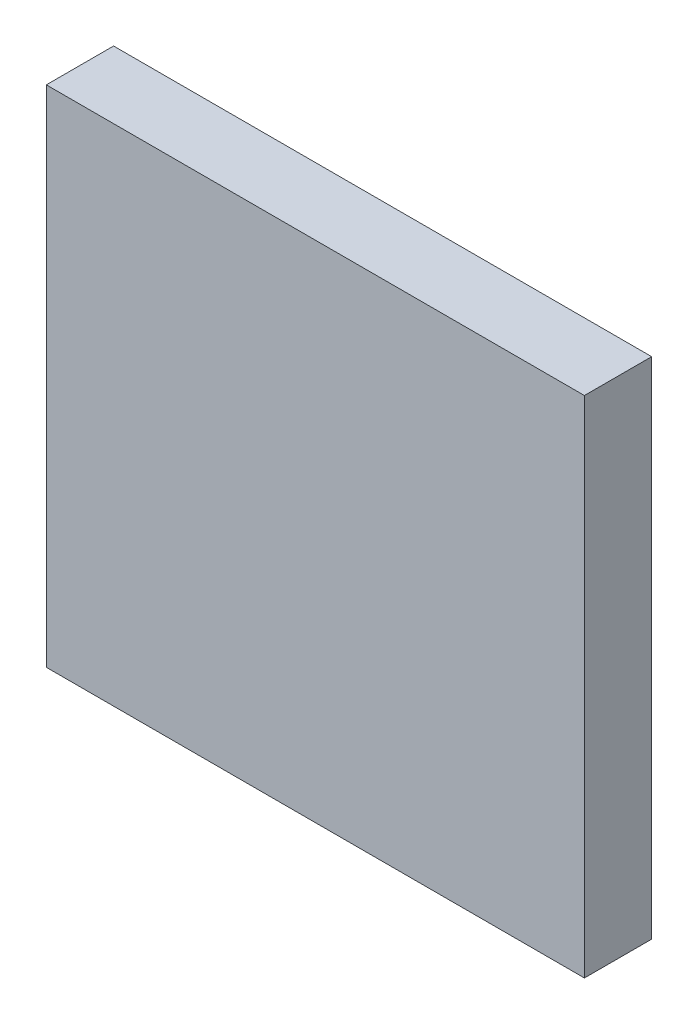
from build123d import *

# Parameters (mm, degrees)
SKETCH1_W           = 50.8
SKETCH1_H           = 47.625
BOSS_EXTRUDE1_DEPTH = 6.35


with BuildPart() as part:
    # Sketch1 → Boss-Extrude1 (new body)
    with BuildSketch(Plane.XY):
        with Locations((25.4, 23.8125)):
            Rectangle(SKETCH1_W, SKETCH1_H)
    extrude(amount=BOSS_EXTRUDE1_DEPTH)


solid = part.part
